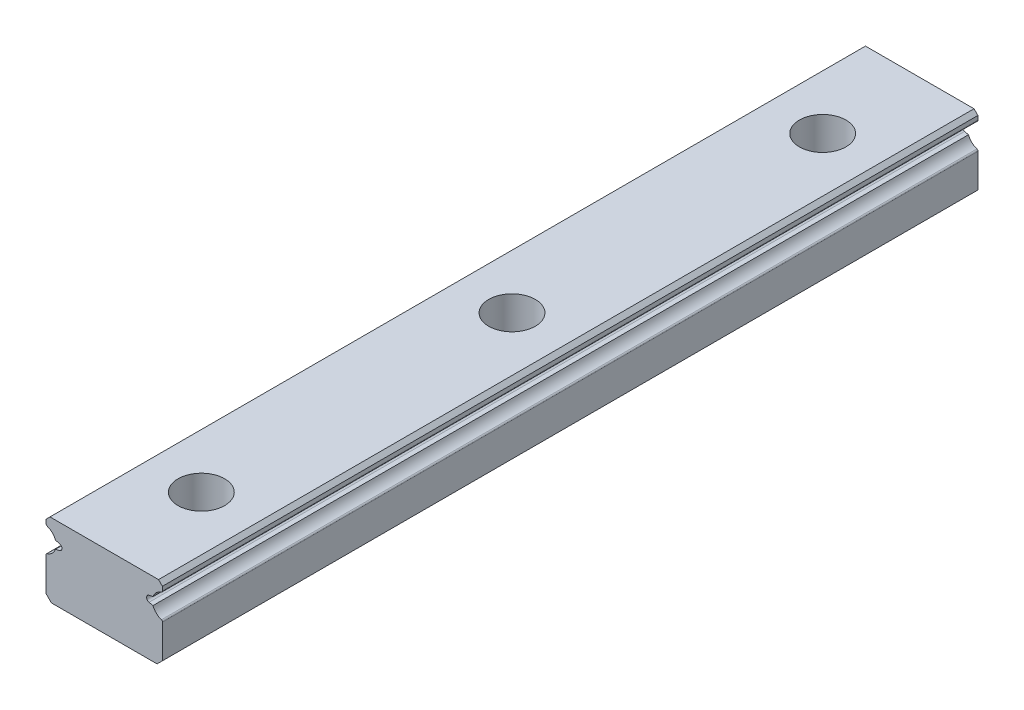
ISO-10303-21;
HEADER;
FILE_DESCRIPTION(('STEP AP214'),'2;1');
FILE_NAME('part.step','',(''),(''),'','','');
FILE_SCHEMA(('AUTOMOTIVE_DESIGN { 1 0 10303 214 1 1 1 1 }'));
ENDSEC;
DATA;
#1=APPLICATION_CONTEXT('core data for automotive mechanical design processes');
#2=APPLICATION_PROTOCOL_DEFINITION('international standard','automotive_design',2000,#1);
#3=PRODUCT_CONTEXT('',#1,'mechanical');
#4=PRODUCT('Part','Part','',(#3));
#5=PRODUCT_RELATED_PRODUCT_CATEGORY('part','',(#4));
#6=PRODUCT_DEFINITION_FORMATION('','',#4);
#7=PRODUCT_DEFINITION_CONTEXT('part definition',#1,'design');
#8=PRODUCT_DEFINITION('design','',#6,#7);
#9=PRODUCT_DEFINITION_SHAPE('','',#8);
#10=(LENGTH_UNIT() NAMED_UNIT(*) SI_UNIT(.MILLI.,.METRE.));
#11=(NAMED_UNIT(*) PLANE_ANGLE_UNIT() SI_UNIT($,.RADIAN.));
#12=(NAMED_UNIT(*) SI_UNIT($,.STERADIAN.) SOLID_ANGLE_UNIT());
#13=UNCERTAINTY_MEASURE_WITH_UNIT(LENGTH_MEASURE(1.E-05),#10,'distance_accuracy_value','');
#14=(GEOMETRIC_REPRESENTATION_CONTEXT(3) GLOBAL_UNCERTAINTY_ASSIGNED_CONTEXT((#13)) GLOBAL_UNIT_ASSIGNED_CONTEXT((#10,
#11,#12)) REPRESENTATION_CONTEXT('',''));
#15=CARTESIAN_POINT('',(0.,0.,0.));
#16=DIRECTION('',(0.,0.,1.));
#17=DIRECTION('',(1.,0.,0.));
#18=AXIS2_PLACEMENT_3D('',#15,#16,#17);
#19=CARTESIAN_POINT('',(-6.27999999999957,-8.749,-105.));
#20=DIRECTION('',(-0.209659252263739,-0.977774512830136,0.));
#21=DIRECTION('',(0.977774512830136,-0.209659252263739,0.));
#22=AXIS2_PLACEMENT_3D('',#19,#20,#21);
#23=PLANE('',#22);
#24=DIRECTION('',(0.977774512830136,-0.209659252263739,0.));
#25=VECTOR('',#24,1.);
#26=CARTESIAN_POINT('',(-6.27999999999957,-8.749,-105.));
#27=LINE('',#26,#25);
#28=CARTESIAN_POINT('',(-6.27999999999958,-8.749,-105.));
#29=VERTEX_POINT('',#28);
#30=CARTESIAN_POINT('',(-5.76751090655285,-8.85889044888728,-105.));
#31=VERTEX_POINT('',#30);
#32=EDGE_CURVE('E211',#29,#31,#27,.T.);
#33=ORIENTED_EDGE('',*,*,#32,.T.);
#34=DIRECTION('',(0.,0.,-1.));
#35=VECTOR('',#34,1.);
#36=CARTESIAN_POINT('',(-5.76751053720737,-8.85889052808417,-105.));
#37=LINE('',#36,#35);
#38=CARTESIAN_POINT('',(-5.76751090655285,-8.85889044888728,0.));
#39=VERTEX_POINT('',#38);
#40=EDGE_CURVE('E182',#31,#39,#37,.F.);
#41=ORIENTED_EDGE('',*,*,#40,.T.);
#42=DIRECTION('',(0.977774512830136,-0.209659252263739,0.));
#43=VECTOR('',#42,1.);
#44=CARTESIAN_POINT('',(-6.27999999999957,-8.749,0.));
#45=LINE('',#44,#43);
#46=CARTESIAN_POINT('',(-6.27999999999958,-8.749,0.));
#47=VERTEX_POINT('',#46);
#48=EDGE_CURVE('E219',#39,#47,#45,.F.);
#49=ORIENTED_EDGE('',*,*,#48,.T.);
#50=DIRECTION('',(0.,0.,-1.));
#51=VECTOR('',#50,1.);
#52=CARTESIAN_POINT('',(-6.27999999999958,-8.749,-105.));
#53=LINE('',#52,#51);
#54=EDGE_CURVE('E214',#47,#29,#53,.T.);
#55=ORIENTED_EDGE('',*,*,#54,.T.);
#56=EDGE_LOOP('',(#33,#41,#49,#55));
#57=FACE_BOUND('',#56,.T.);
#58=ADVANCED_FACE('F16',(#57),#23,.T.);
#59=CARTESIAN_POINT('',(5.7675105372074,-8.85889052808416,-105.));
#60=DIRECTION('',(0.20965925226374,-0.977774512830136,0.));
#61=DIRECTION('',(0.977774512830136,0.20965925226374,0.));
#62=AXIS2_PLACEMENT_3D('',#59,#60,#61);
#63=PLANE('',#62);
#64=DIRECTION('',(0.977774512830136,0.20965925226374,0.));
#65=VECTOR('',#64,1.);
#66=CARTESIAN_POINT('',(5.7675105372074,-8.85889052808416,-105.));
#67=LINE('',#66,#65);
#68=CARTESIAN_POINT('',(5.76751090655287,-8.85889044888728,-105.));
#69=VERTEX_POINT('',#68);
#70=CARTESIAN_POINT('',(6.27999999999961,-8.749,-105.));
#71=VERTEX_POINT('',#70);
#72=EDGE_CURVE('E184',#69,#71,#67,.T.);
#73=ORIENTED_EDGE('',*,*,#72,.T.);
#74=DIRECTION('',(0.,0.,-1.));
#75=VECTOR('',#74,1.);
#76=CARTESIAN_POINT('',(6.27999999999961,-8.749,-105.));
#77=LINE('',#76,#75);
#78=CARTESIAN_POINT('',(6.27999999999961,-8.749,0.));
#79=VERTEX_POINT('',#78);
#80=EDGE_CURVE('E222',#71,#79,#77,.F.);
#81=ORIENTED_EDGE('',*,*,#80,.T.);
#82=DIRECTION('',(0.977774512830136,0.20965925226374,0.));
#83=VECTOR('',#82,1.);
#84=CARTESIAN_POINT('',(5.7675105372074,-8.85889052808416,0.));
#85=LINE('',#84,#83);
#86=CARTESIAN_POINT('',(5.76751090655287,-8.85889044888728,0.));
#87=VERTEX_POINT('',#86);
#88=EDGE_CURVE('E209',#79,#87,#85,.F.);
#89=ORIENTED_EDGE('',*,*,#88,.T.);
#90=DIRECTION('',(0.,0.,-1.));
#91=VECTOR('',#90,1.);
#92=CARTESIAN_POINT('',(5.7675105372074,-8.85889052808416,-105.));
#93=LINE('',#92,#91);
#94=EDGE_CURVE('E204',#87,#69,#93,.T.);
#95=ORIENTED_EDGE('',*,*,#94,.T.);
#96=EDGE_LOOP('',(#73,#81,#89,#95));
#97=FACE_BOUND('',#96,.T.);
#98=ADVANCED_FACE('F792',(#97),#63,.T.);
#99=CARTESIAN_POINT('',(-5.85137497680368,-9.25000017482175,-105.));
#100=DIRECTION('',(0.,0.,-1.));
#101=DIRECTION('',(-1.,0.,0.));
#102=AXIS2_PLACEMENT_3D('',#99,#100,#101);
#103=CYLINDRICAL_SURFACE('',#102,0.4);
#104=ORIENTED_EDGE('',*,*,#40,.F.);
#105=CARTESIAN_POINT('',(-5.85137497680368,-9.25000017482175,-105.));
#106=DIRECTION('',(0.,0.,-1.));
#107=DIRECTION('',(-1.,0.,0.));
#108=AXIS2_PLACEMENT_3D('',#105,#106,#107);
#109=CIRCLE('',#108,0.4);
#110=CARTESIAN_POINT('',(-5.767,-9.641,-105.));
#111=VERTEX_POINT('',#110);
#112=EDGE_CURVE('E19',#111,#31,#109,.F.);
#113=ORIENTED_EDGE('',*,*,#112,.F.);
#114=DIRECTION('',(0.,0.,1.));
#115=VECTOR('',#114,1.);
#116=CARTESIAN_POINT('',(-5.767,-9.641,-105.));
#117=LINE('',#116,#115);
#118=CARTESIAN_POINT('',(-5.767,-9.641,0.));
#119=VERTEX_POINT('',#118);
#120=EDGE_CURVE('E179',#119,#111,#117,.F.);
#121=ORIENTED_EDGE('',*,*,#120,.F.);
#122=CARTESIAN_POINT('',(-5.85137497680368,-9.25000017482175,0.));
#123=DIRECTION('',(0.,0.,-1.));
#124=DIRECTION('',(-1.,0.,0.));
#125=AXIS2_PLACEMENT_3D('',#122,#123,#124);
#126=CIRCLE('',#125,0.4);
#127=EDGE_CURVE('E226',#39,#119,#126,.T.);
#128=ORIENTED_EDGE('',*,*,#127,.F.);
#129=EDGE_LOOP('',(#104,#113,#121,#128));
#130=FACE_BOUND('',#129,.T.);
#131=ADVANCED_FACE('F176',(#130),#103,.F.);
#132=CARTESIAN_POINT('',(7.89004225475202,-9.33975285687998,-105.));
#133=DIRECTION('',(0.,0.,-1.));
#134=DIRECTION('',(-1.,0.,0.));
#135=AXIS2_PLACEMENT_3D('',#132,#133,#134);
#136=CYLINDRICAL_SURFACE('',#135,1.715);
#137=ORIENTED_EDGE('',*,*,#80,.F.);
#138=CARTESIAN_POINT('',(7.89004225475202,-9.33975285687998,-105.));
#139=DIRECTION('',(0.,0.,-1.));
#140=DIRECTION('',(-1.,0.,0.));
#141=AXIS2_PLACEMENT_3D('',#138,#139,#140);
#142=CIRCLE('',#141,1.715);
#143=CARTESIAN_POINT('',(7.35000000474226,-7.71199999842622,-105.));
#144=VERTEX_POINT('',#143);
#145=EDGE_CURVE('E225',#144,#71,#142,.F.);
#146=ORIENTED_EDGE('',*,*,#145,.F.);
#147=DIRECTION('',(0.,0.,-1.));
#148=VECTOR('',#147,1.);
#149=CARTESIAN_POINT('',(7.35000000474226,-7.71199999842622,-105.));
#150=LINE('',#149,#148);
#151=CARTESIAN_POINT('',(7.35000000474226,-7.71199999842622,0.));
#152=VERTEX_POINT('',#151);
#153=EDGE_CURVE('E202',#152,#144,#150,.T.);
#154=ORIENTED_EDGE('',*,*,#153,.F.);
#155=CARTESIAN_POINT('',(7.89004225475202,-9.33975285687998,0.));
#156=DIRECTION('',(0.,0.,-1.));
#157=DIRECTION('',(-1.,0.,0.));
#158=AXIS2_PLACEMENT_3D('',#155,#156,#157);
#159=CIRCLE('',#158,1.715);
#160=EDGE_CURVE('E218',#79,#152,#159,.T.);
#161=ORIENTED_EDGE('',*,*,#160,.F.);
#162=EDGE_LOOP('',(#137,#146,#154,#161));
#163=FACE_BOUND('',#162,.T.);
#164=ADVANCED_FACE('F776',(#163),#136,.F.);
#165=CARTESIAN_POINT('',(-7.890042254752,-9.33975285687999,-105.));
#166=DIRECTION('',(0.,0.,-1.));
#167=DIRECTION('',(-1.,0.,0.));
#168=AXIS2_PLACEMENT_3D('',#165,#166,#167);
#169=CYLINDRICAL_SURFACE('',#168,1.715);
#170=DIRECTION('',(0.,0.,-1.));
#171=VECTOR('',#170,1.);
#172=CARTESIAN_POINT('',(-7.34999999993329,-7.7120000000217,-105.));
#173=LINE('',#172,#171);
#174=CARTESIAN_POINT('',(-7.34999999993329,-7.71200000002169,-105.));
#175=VERTEX_POINT('',#174);
#176=CARTESIAN_POINT('',(-7.34999999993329,-7.7120000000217,0.));
#177=VERTEX_POINT('',#176);
#178=EDGE_CURVE('E297',#175,#177,#173,.F.);
#179=ORIENTED_EDGE('',*,*,#178,.F.);
#180=CARTESIAN_POINT('',(-7.890042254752,-9.33975285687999,-105.));
#181=DIRECTION('',(0.,0.,-1.));
#182=DIRECTION('',(-1.,0.,0.));
#183=AXIS2_PLACEMENT_3D('',#180,#181,#182);
#184=CIRCLE('',#183,1.715);
#185=EDGE_CURVE('E217',#29,#175,#184,.F.);
#186=ORIENTED_EDGE('',*,*,#185,.F.);
#187=ORIENTED_EDGE('',*,*,#54,.F.);
#188=CARTESIAN_POINT('',(-7.890042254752,-9.33975285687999,0.));
#189=DIRECTION('',(0.,0.,-1.));
#190=DIRECTION('',(-1.,0.,0.));
#191=AXIS2_PLACEMENT_3D('',#188,#189,#190);
#192=CIRCLE('',#191,1.715);
#193=EDGE_CURVE('E208',#177,#47,#192,.T.);
#194=ORIENTED_EDGE('',*,*,#193,.F.);
#195=EDGE_LOOP('',(#179,#186,#187,#194));
#196=FACE_BOUND('',#195,.T.);
#197=ADVANCED_FACE('F322',(#196),#169,.F.);
#198=CARTESIAN_POINT('',(5.85137497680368,-9.25000017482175,-105.));
#199=DIRECTION('',(0.,0.,-1.));
#200=DIRECTION('',(-1.,0.,0.));
#201=AXIS2_PLACEMENT_3D('',#198,#199,#200);
#202=CYLINDRICAL_SURFACE('',#201,0.4);
#203=DIRECTION('',(0.,0.,1.));
#204=VECTOR('',#203,1.);
#205=CARTESIAN_POINT('',(5.767,-9.641,-105.));
#206=LINE('',#205,#204);
#207=CARTESIAN_POINT('',(5.767,-9.641,-105.));
#208=VERTEX_POINT('',#207);
#209=CARTESIAN_POINT('',(5.767,-9.641,0.));
#210=VERTEX_POINT('',#209);
#211=EDGE_CURVE('E293',#208,#210,#206,.T.);
#212=ORIENTED_EDGE('',*,*,#211,.F.);
#213=CARTESIAN_POINT('',(5.85137497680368,-9.25000017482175,-105.));
#214=DIRECTION('',(0.,0.,-1.));
#215=DIRECTION('',(-1.,0.,0.));
#216=AXIS2_PLACEMENT_3D('',#213,#214,#215);
#217=CIRCLE('',#216,0.4);
#218=EDGE_CURVE('E207',#69,#208,#217,.F.);
#219=ORIENTED_EDGE('',*,*,#218,.F.);
#220=ORIENTED_EDGE('',*,*,#94,.F.);
#221=CARTESIAN_POINT('',(5.85137497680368,-9.25000017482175,0.));
#222=DIRECTION('',(0.,0.,-1.));
#223=DIRECTION('',(-1.,0.,0.));
#224=AXIS2_PLACEMENT_3D('',#221,#222,#223);
#225=CIRCLE('',#224,0.4);
#226=EDGE_CURVE('E198',#210,#87,#225,.T.);
#227=ORIENTED_EDGE('',*,*,#226,.F.);
#228=EDGE_LOOP('',(#212,#219,#220,#227));
#229=FACE_BOUND('',#228,.T.);
#230=ADVANCED_FACE('F760',(#229),#202,.F.);
#231=CARTESIAN_POINT('',(-5.767,-9.641,-105.));
#232=DIRECTION('',(-0.207835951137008,0.978163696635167,0.));
#233=DIRECTION('',(-0.978163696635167,-0.207835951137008,0.));
#234=AXIS2_PLACEMENT_3D('',#231,#232,#233);
#235=PLANE('',#234);
#236=DIRECTION('',(-0.978163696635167,-0.207835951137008,0.));
#237=VECTOR('',#236,1.);
#238=CARTESIAN_POINT('',(-5.767,-9.641,-105.));
#239=LINE('',#238,#237);
#240=CARTESIAN_POINT('',(-6.28,-9.75,-105.));
#241=VERTEX_POINT('',#240);
#242=EDGE_CURVE('E186',#111,#241,#239,.T.);
#243=ORIENTED_EDGE('',*,*,#242,.T.);
#244=DIRECTION('',(0.,0.,-1.));
#245=VECTOR('',#244,1.);
#246=CARTESIAN_POINT('',(-6.28,-9.75,-105.));
#247=LINE('',#246,#245);
#248=CARTESIAN_POINT('',(-6.28,-9.75,0.));
#249=VERTEX_POINT('',#248);
#250=EDGE_CURVE('E291',#241,#249,#247,.F.);
#251=ORIENTED_EDGE('',*,*,#250,.T.);
#252=DIRECTION('',(-0.978163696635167,-0.207835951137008,0.));
#253=VECTOR('',#252,1.);
#254=CARTESIAN_POINT('',(-5.767,-9.641,0.));
#255=LINE('',#254,#253);
#256=EDGE_CURVE('E196',#249,#119,#255,.F.);
#257=ORIENTED_EDGE('',*,*,#256,.T.);
#258=ORIENTED_EDGE('',*,*,#120,.T.);
#259=EDGE_LOOP('',(#243,#251,#257,#258));
#260=FACE_BOUND('',#259,.T.);
#261=ADVANCED_FACE('F195',(#260),#235,.T.);
#262=CARTESIAN_POINT('',(7.287,-7.52218166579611,-105.));
#263=DIRECTION('',(0.,0.,-1.));
#264=DIRECTION('',(-1.,0.,0.));
#265=AXIS2_PLACEMENT_3D('',#262,#263,#264);
#266=CYLINDRICAL_SURFACE('',#265,0.2);
#267=CARTESIAN_POINT('',(7.287,-7.52218166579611,-105.));
#268=DIRECTION('',(0.,0.,-1.));
#269=DIRECTION('',(-1.,0.,0.));
#270=AXIS2_PLACEMENT_3D('',#267,#268,#269);
#271=CIRCLE('',#270,0.2);
#272=CARTESIAN_POINT('',(7.487,-7.52218165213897,-105.));
#273=VERTEX_POINT('',#272);
#274=EDGE_CURVE('E301',#144,#273,#271,.F.);
#275=ORIENTED_EDGE('',*,*,#274,.T.);
#276=DIRECTION('',(0.,0.,-1.));
#277=VECTOR('',#276,1.);
#278=CARTESIAN_POINT('',(7.487,-7.52218163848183,-105.));
#279=LINE('',#278,#277);
#280=CARTESIAN_POINT('',(7.487,-7.52218165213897,0.));
#281=VERTEX_POINT('',#280);
#282=EDGE_CURVE('E359',#281,#273,#279,.T.);
#283=ORIENTED_EDGE('',*,*,#282,.F.);
#284=CARTESIAN_POINT('',(7.287,-7.52218166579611,0.));
#285=DIRECTION('',(0.,0.,-1.));
#286=DIRECTION('',(-1.,0.,0.));
#287=AXIS2_PLACEMENT_3D('',#284,#285,#286);
#288=CIRCLE('',#287,0.2);
#289=EDGE_CURVE('E193',#281,#152,#288,.T.);
#290=ORIENTED_EDGE('',*,*,#289,.T.);
#291=ORIENTED_EDGE('',*,*,#153,.T.);
#292=EDGE_LOOP('',(#275,#283,#290,#291));
#293=FACE_BOUND('',#292,.T.);
#294=ADVANCED_FACE('F745',(#293),#266,.T.);
#295=CARTESIAN_POINT('',(-7.288,-7.52185268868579,-105.));
#296=DIRECTION('',(0.,0.,-1.));
#297=DIRECTION('',(-1.,0.,0.));
#298=AXIS2_PLACEMENT_3D('',#295,#296,#297);
#299=CYLINDRICAL_SURFACE('',#298,0.200000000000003);
#300=CARTESIAN_POINT('',(-7.288,-7.52185268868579,-105.));
#301=DIRECTION('',(0.,0.,-1.));
#302=DIRECTION('',(-1.,0.,0.));
#303=AXIS2_PLACEMENT_3D('',#300,#301,#302);
#304=CIRCLE('',#303,0.200000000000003);
#305=CARTESIAN_POINT('',(-7.488,-7.52185267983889,-105.));
#306=VERTEX_POINT('',#305);
#307=EDGE_CURVE('E294',#306,#175,#304,.F.);
#308=ORIENTED_EDGE('',*,*,#307,.T.);
#309=ORIENTED_EDGE('',*,*,#178,.T.);
#310=CARTESIAN_POINT('',(-7.288,-7.52185268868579,0.));
#311=DIRECTION('',(0.,0.,-1.));
#312=DIRECTION('',(-1.,0.,0.));
#313=AXIS2_PLACEMENT_3D('',#310,#311,#312);
#314=CIRCLE('',#313,0.200000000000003);
#315=CARTESIAN_POINT('',(-7.488,-7.52185267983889,0.));
#316=VERTEX_POINT('',#315);
#317=EDGE_CURVE('E298',#177,#316,#314,.T.);
#318=ORIENTED_EDGE('',*,*,#317,.T.);
#319=DIRECTION('',(0.,0.,1.));
#320=VECTOR('',#319,1.);
#321=CARTESIAN_POINT('',(-7.488,-7.52185267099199,-105.));
#322=LINE('',#321,#320);
#323=EDGE_CURVE('E327',#306,#316,#322,.T.);
#324=ORIENTED_EDGE('',*,*,#323,.F.);
#325=EDGE_LOOP('',(#308,#309,#318,#324));
#326=FACE_BOUND('',#325,.T.);
#327=ADVANCED_FACE('F325',(#326),#299,.T.);
#328=CARTESIAN_POINT('',(6.28,-9.75,-105.));
#329=DIRECTION('',(0.207835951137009,0.978163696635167,0.));
#330=DIRECTION('',(-0.978163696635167,0.207835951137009,0.));
#331=AXIS2_PLACEMENT_3D('',#328,#329,#330);
#332=PLANE('',#331);
#333=DIRECTION('',(-0.978163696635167,0.207835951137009,0.));
#334=VECTOR('',#333,1.);
#335=CARTESIAN_POINT('',(6.28,-9.75,-105.));
#336=LINE('',#335,#334);
#337=CARTESIAN_POINT('',(6.28,-9.75,-105.));
#338=VERTEX_POINT('',#337);
#339=EDGE_CURVE('E383',#338,#208,#336,.T.);
#340=ORIENTED_EDGE('',*,*,#339,.T.);
#341=ORIENTED_EDGE('',*,*,#211,.T.);
#342=DIRECTION('',(-0.978163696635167,0.207835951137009,0.));
#343=VECTOR('',#342,1.);
#344=CARTESIAN_POINT('',(6.28,-9.75,0.));
#345=LINE('',#344,#343);
#346=CARTESIAN_POINT('',(6.28,-9.75,0.));
#347=VERTEX_POINT('',#346);
#348=EDGE_CURVE('E324',#210,#347,#345,.F.);
#349=ORIENTED_EDGE('',*,*,#348,.T.);
#350=DIRECTION('',(0.,0.,-1.));
#351=VECTOR('',#350,1.);
#352=CARTESIAN_POINT('',(6.28,-9.75,-105.));
#353=LINE('',#352,#351);
#354=EDGE_CURVE('E287',#347,#338,#353,.T.);
#355=ORIENTED_EDGE('',*,*,#354,.T.);
#356=EDGE_LOOP('',(#340,#341,#349,#355));
#357=FACE_BOUND('',#356,.T.);
#358=ADVANCED_FACE('F490',(#357),#332,.T.);
#359=CARTESIAN_POINT('',(-7.89007044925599,-9.159323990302,-105.));
#360=DIRECTION('',(0.,0.,-1.));
#361=DIRECTION('',(-1.,0.,0.));
#362=AXIS2_PLACEMENT_3D('',#359,#360,#361);
#363=CYLINDRICAL_SURFACE('',#362,1.715);
#364=ORIENTED_EDGE('',*,*,#250,.F.);
#365=CARTESIAN_POINT('',(-7.89007044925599,-9.159323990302,-105.));
#366=DIRECTION('',(0.,0.,-1.));
#367=DIRECTION('',(-1.,0.,0.));
#368=AXIS2_PLACEMENT_3D('',#365,#366,#367);
#369=CIRCLE('',#368,1.715);
#370=CARTESIAN_POINT('',(-7.36199999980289,-10.7909999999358,-105.));
#371=VERTEX_POINT('',#370);
#372=EDGE_CURVE('E189',#371,#241,#369,.F.);
#373=ORIENTED_EDGE('',*,*,#372,.F.);
#374=DIRECTION('',(0.,0.,-1.));
#375=VECTOR('',#374,1.);
#376=CARTESIAN_POINT('',(-7.36199999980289,-10.7909999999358,-105.));
#377=LINE('',#376,#375);
#378=CARTESIAN_POINT('',(-7.36199999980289,-10.7909999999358,0.));
#379=VERTEX_POINT('',#378);
#380=EDGE_CURVE('E278',#379,#371,#377,.T.);
#381=ORIENTED_EDGE('',*,*,#380,.F.);
#382=CARTESIAN_POINT('',(-7.89007044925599,-9.159323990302,0.));
#383=DIRECTION('',(0.,0.,-1.));
#384=DIRECTION('',(-1.,0.,0.));
#385=AXIS2_PLACEMENT_3D('',#382,#383,#384);
#386=CIRCLE('',#385,1.715);
#387=EDGE_CURVE('E288',#249,#379,#386,.T.);
#388=ORIENTED_EDGE('',*,*,#387,.F.);
#389=EDGE_LOOP('',(#364,#373,#381,#388));
#390=FACE_BOUND('',#389,.T.);
#391=ADVANCED_FACE('F487',(#390),#363,.F.);
#392=CARTESIAN_POINT('',(7.487,-7.52218163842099,-105.));
#393=DIRECTION('',(1.,0.,0.));
#394=DIRECTION('',(0.,0.,-1.));
#395=AXIS2_PLACEMENT_3D('',#392,#393,#394);
#396=PLANE('',#395);
#397=DIRECTION('',(0.,1.,0.));
#398=VECTOR('',#397,1.);
#399=CARTESIAN_POINT('',(7.487,-7.52218163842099,-105.));
#400=LINE('',#399,#398);
#401=CARTESIAN_POINT('',(7.487,-7.,-105.));
#402=VERTEX_POINT('',#401);
#403=EDGE_CURVE('E339',#273,#402,#400,.T.);
#404=ORIENTED_EDGE('',*,*,#403,.T.);
#405=DIRECTION('',(0.,0.,1.));
#406=VECTOR('',#405,1.);
#407=CARTESIAN_POINT('',(7.487,-7.,-105.));
#408=LINE('',#407,#406);
#409=CARTESIAN_POINT('',(7.487,-7.,0.));
#410=VERTEX_POINT('',#409);
#411=EDGE_CURVE('E366',#410,#402,#408,.F.);
#412=ORIENTED_EDGE('',*,*,#411,.F.);
#413=DIRECTION('',(0.,1.,0.));
#414=VECTOR('',#413,1.);
#415=CARTESIAN_POINT('',(7.487,-7.52218163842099,0.));
#416=LINE('',#415,#414);
#417=EDGE_CURVE('E290',#410,#281,#416,.F.);
#418=ORIENTED_EDGE('',*,*,#417,.T.);
#419=ORIENTED_EDGE('',*,*,#282,.T.);
#420=EDGE_LOOP('',(#404,#412,#418,#419));
#421=FACE_BOUND('',#420,.T.);
#422=ADVANCED_FACE('F489',(#421),#396,.T.);
#423=CARTESIAN_POINT('',(-7.488,-7.,-105.));
#424=DIRECTION('',(-1.,0.,0.));
#425=DIRECTION('',(0.,0.,1.));
#426=AXIS2_PLACEMENT_3D('',#423,#424,#425);
#427=PLANE('',#426);
#428=DIRECTION('',(0.,1.,0.));
#429=VECTOR('',#428,1.);
#430=CARTESIAN_POINT('',(-7.488,-7.,-105.));
#431=LINE('',#430,#429);
#432=CARTESIAN_POINT('',(-7.488,-7.,-105.));
#433=VERTEX_POINT('',#432);
#434=EDGE_CURVE('E331',#433,#306,#431,.F.);
#435=ORIENTED_EDGE('',*,*,#434,.T.);
#436=ORIENTED_EDGE('',*,*,#323,.T.);
#437=DIRECTION('',(0.,1.,0.));
#438=VECTOR('',#437,1.);
#439=CARTESIAN_POINT('',(-7.488,-7.,0.));
#440=LINE('',#439,#438);
#441=CARTESIAN_POINT('',(-7.488,-7.,0.));
#442=VERTEX_POINT('',#441);
#443=EDGE_CURVE('E337',#316,#442,#440,.T.);
#444=ORIENTED_EDGE('',*,*,#443,.T.);
#445=DIRECTION('',(0.,0.,1.));
#446=VECTOR('',#445,1.);
#447=CARTESIAN_POINT('',(-7.488,-7.,-105.));
#448=LINE('',#447,#446);
#449=EDGE_CURVE('E274',#433,#442,#448,.T.);
#450=ORIENTED_EDGE('',*,*,#449,.F.);
#451=EDGE_LOOP('',(#435,#436,#444,#450));
#452=FACE_BOUND('',#451,.T.);
#453=ADVANCED_FACE('F334',(#452),#427,.T.);
#454=CARTESIAN_POINT('',(7.890070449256,-9.159323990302,-105.));
#455=DIRECTION('',(0.,0.,-1.));
#456=DIRECTION('',(-1.,0.,0.));
#457=AXIS2_PLACEMENT_3D('',#454,#455,#456);
#458=CYLINDRICAL_SURFACE('',#457,1.715);
#459=DIRECTION('',(0.,0.,-1.));
#460=VECTOR('',#459,1.);
#461=CARTESIAN_POINT('',(7.36199999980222,-10.7909999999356,-105.));
#462=LINE('',#461,#460);
#463=CARTESIAN_POINT('',(7.36199999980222,-10.7909999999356,-105.));
#464=VERTEX_POINT('',#463);
#465=CARTESIAN_POINT('',(7.36199999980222,-10.7909999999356,0.));
#466=VERTEX_POINT('',#465);
#467=EDGE_CURVE('E268',#464,#466,#462,.F.);
#468=ORIENTED_EDGE('',*,*,#467,.F.);
#469=CARTESIAN_POINT('',(7.890070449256,-9.159323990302,-105.));
#470=DIRECTION('',(0.,0.,-1.));
#471=DIRECTION('',(-1.,0.,0.));
#472=AXIS2_PLACEMENT_3D('',#469,#470,#471);
#473=CIRCLE('',#472,1.715);
#474=EDGE_CURVE('E285',#338,#464,#473,.F.);
#475=ORIENTED_EDGE('',*,*,#474,.F.);
#476=ORIENTED_EDGE('',*,*,#354,.F.);
#477=CARTESIAN_POINT('',(7.890070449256,-9.159323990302,0.));
#478=DIRECTION('',(0.,0.,-1.));
#479=DIRECTION('',(-1.,0.,0.));
#480=AXIS2_PLACEMENT_3D('',#477,#478,#479);
#481=CIRCLE('',#480,1.715);
#482=EDGE_CURVE('E282',#466,#347,#481,.T.);
#483=ORIENTED_EDGE('',*,*,#482,.F.);
#484=EDGE_LOOP('',(#468,#475,#476,#483));
#485=FACE_BOUND('',#484,.T.);
#486=ADVANCED_FACE('F577',(#485),#458,.F.);
#487=CARTESIAN_POINT('',(-7.3,-10.9811473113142,-105.));
#488=DIRECTION('',(0.,0.,-1.));
#489=DIRECTION('',(-1.,0.,0.));
#490=AXIS2_PLACEMENT_3D('',#487,#488,#489);
#491=CYLINDRICAL_SURFACE('',#490,0.200000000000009);
#492=CARTESIAN_POINT('',(-7.3,-10.9811473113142,-105.));
#493=DIRECTION('',(0.,0.,-1.));
#494=DIRECTION('',(-1.,0.,0.));
#495=AXIS2_PLACEMENT_3D('',#492,#493,#494);
#496=CIRCLE('',#495,0.200000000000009);
#497=CARTESIAN_POINT('',(-7.5,-10.9811473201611,-105.));
#498=VERTEX_POINT('',#497);
#499=EDGE_CURVE('E275',#371,#498,#496,.F.);
#500=ORIENTED_EDGE('',*,*,#499,.T.);
#501=DIRECTION('',(0.,0.,1.));
#502=VECTOR('',#501,1.);
#503=CARTESIAN_POINT('',(-7.5,-10.981147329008,-105.));
#504=LINE('',#503,#502);
#505=CARTESIAN_POINT('',(-7.5,-10.9811473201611,0.));
#506=VERTEX_POINT('',#505);
#507=EDGE_CURVE('E264',#506,#498,#504,.F.);
#508=ORIENTED_EDGE('',*,*,#507,.F.);
#509=CARTESIAN_POINT('',(-7.3,-10.9811473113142,0.));
#510=DIRECTION('',(0.,0.,-1.));
#511=DIRECTION('',(-1.,0.,0.));
#512=AXIS2_PLACEMENT_3D('',#509,#510,#511);
#513=CIRCLE('',#512,0.200000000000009);
#514=EDGE_CURVE('E279',#506,#379,#513,.T.);
#515=ORIENTED_EDGE('',*,*,#514,.T.);
#516=ORIENTED_EDGE('',*,*,#380,.T.);
#517=EDGE_LOOP('',(#500,#508,#515,#516));
#518=FACE_BOUND('',#517,.T.);
#519=ADVANCED_FACE('F483',(#518),#491,.T.);
#520=CARTESIAN_POINT('',(0.,-16.,-52.5));
#521=DIRECTION('',(0.,1.,0.));
#522=DIRECTION('',(0.,0.,1.));
#523=AXIS2_PLACEMENT_3D('',#520,#521,#522);
#524=CYLINDRICAL_SURFACE('',#523,3.);
#525=CARTESIAN_POINT('',(0.,-6.5,-52.5));
#526=DIRECTION('',(0.,1.,0.));
#527=DIRECTION('',(0.,0.,1.));
#528=AXIS2_PLACEMENT_3D('',#525,#526,#527);
#529=CIRCLE('',#528,3.);
#530=CARTESIAN_POINT('',(0.,-6.5,-49.5));
#531=VERTEX_POINT('',#530);
#532=EDGE_CURVE('E260',#531,#531,#529,.F.);
#533=ORIENTED_EDGE('',*,*,#532,.F.);
#534=EDGE_LOOP('',(#533));
#535=FACE_BOUND('',#534,.T.);
#536=CARTESIAN_POINT('',(0.,-11.,-52.5));
#537=DIRECTION('',(0.,1.,0.));
#538=DIRECTION('',(0.,0.,1.));
#539=AXIS2_PLACEMENT_3D('',#536,#537,#538);
#540=CIRCLE('',#539,3.);
#541=CARTESIAN_POINT('',(0.,-11.,-49.5));
#542=VERTEX_POINT('',#541);
#543=EDGE_CURVE('E265',#542,#542,#540,.T.);
#544=ORIENTED_EDGE('',*,*,#543,.F.);
#545=EDGE_LOOP('',(#544));
#546=FACE_BOUND('',#545,.T.);
#547=ADVANCED_FACE('F570',(#535,#546),#524,.F.);
#548=CARTESIAN_POINT('',(7.487,-7.,-105.));
#549=DIRECTION('',(0.707106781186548,0.707106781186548,0.));
#550=DIRECTION('',(-0.707106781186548,0.707106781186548,0.));
#551=AXIS2_PLACEMENT_3D('',#548,#549,#550);
#552=PLANE('',#551);
#553=DIRECTION('',(-0.707106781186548,0.707106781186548,0.));
#554=VECTOR('',#553,1.);
#555=CARTESIAN_POINT('',(7.487,-7.,-105.));
#556=LINE('',#555,#554);
#557=CARTESIAN_POINT('',(6.987,-6.5,-105.));
#558=VERTEX_POINT('',#557);
#559=EDGE_CURVE('E356',#402,#558,#556,.T.);
#560=ORIENTED_EDGE('',*,*,#559,.T.);
#561=DIRECTION('',(0.,0.,1.));
#562=VECTOR('',#561,1.);
#563=CARTESIAN_POINT('',(6.987,-6.5,-105.));
#564=LINE('',#563,#562);
#565=CARTESIAN_POINT('',(6.987,-6.5,0.));
#566=VERTEX_POINT('',#565);
#567=EDGE_CURVE('E263',#566,#558,#564,.F.);
#568=ORIENTED_EDGE('',*,*,#567,.F.);
#569=DIRECTION('',(-0.707106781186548,0.707106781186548,0.));
#570=VECTOR('',#569,1.);
#571=CARTESIAN_POINT('',(7.487,-7.,0.));
#572=LINE('',#571,#570);
#573=EDGE_CURVE('E277',#566,#410,#572,.F.);
#574=ORIENTED_EDGE('',*,*,#573,.T.);
#575=ORIENTED_EDGE('',*,*,#411,.T.);
#576=EDGE_LOOP('',(#560,#568,#574,#575));
#577=FACE_BOUND('',#576,.T.);
#578=ADVANCED_FACE('F566',(#577),#552,.T.);
#579=CARTESIAN_POINT('',(-6.988,-6.5,-105.));
#580=DIRECTION('',(-0.707106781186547,0.707106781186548,0.));
#581=DIRECTION('',(-0.707106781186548,-0.707106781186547,0.));
#582=AXIS2_PLACEMENT_3D('',#579,#580,#581);
#583=PLANE('',#582);
#584=DIRECTION('',(-0.707106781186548,-0.707106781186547,0.));
#585=VECTOR('',#584,1.);
#586=CARTESIAN_POINT('',(-6.988,-6.5,-105.));
#587=LINE('',#586,#585);
#588=CARTESIAN_POINT('',(-6.988,-6.5,-105.));
#589=VERTEX_POINT('',#588);
#590=EDGE_CURVE('E346',#589,#433,#587,.T.);
#591=ORIENTED_EDGE('',*,*,#590,.T.);
#592=ORIENTED_EDGE('',*,*,#449,.T.);
#593=DIRECTION('',(-0.707106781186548,-0.707106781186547,0.));
#594=VECTOR('',#593,1.);
#595=CARTESIAN_POINT('',(-6.988,-6.5,0.));
#596=LINE('',#595,#594);
#597=CARTESIAN_POINT('',(-6.988,-6.5,0.));
#598=VERTEX_POINT('',#597);
#599=EDGE_CURVE('E350',#442,#598,#596,.F.);
#600=ORIENTED_EDGE('',*,*,#599,.T.);
#601=DIRECTION('',(0.,0.,1.));
#602=VECTOR('',#601,1.);
#603=CARTESIAN_POINT('',(-6.988,-6.5,-105.));
#604=LINE('',#603,#602);
#605=EDGE_CURVE('E259',#589,#598,#604,.T.);
#606=ORIENTED_EDGE('',*,*,#605,.F.);
#607=EDGE_LOOP('',(#591,#592,#600,#606));
#608=FACE_BOUND('',#607,.T.);
#609=ADVANCED_FACE('F562',(#608),#583,.T.);
#610=CARTESIAN_POINT('',(7.3,-10.9811473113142,-105.));
#611=DIRECTION('',(0.,0.,-1.));
#612=DIRECTION('',(-1.,0.,0.));
#613=AXIS2_PLACEMENT_3D('',#610,#611,#612);
#614=CYLINDRICAL_SURFACE('',#613,0.2);
#615=CARTESIAN_POINT('',(7.3,-10.9811473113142,-105.));
#616=DIRECTION('',(0.,0.,-1.));
#617=DIRECTION('',(-1.,0.,0.));
#618=AXIS2_PLACEMENT_3D('',#615,#616,#617);
#619=CIRCLE('',#618,0.2);
#620=CARTESIAN_POINT('',(7.5,-10.9811473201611,-105.));
#621=VERTEX_POINT('',#620);
#622=EDGE_CURVE('E269',#621,#464,#619,.F.);
#623=ORIENTED_EDGE('',*,*,#622,.T.);
#624=ORIENTED_EDGE('',*,*,#467,.T.);
#625=CARTESIAN_POINT('',(7.3,-10.9811473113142,0.));
#626=DIRECTION('',(0.,0.,-1.));
#627=DIRECTION('',(-1.,0.,0.));
#628=AXIS2_PLACEMENT_3D('',#625,#626,#627);
#629=CIRCLE('',#628,0.2);
#630=CARTESIAN_POINT('',(7.5,-10.9811473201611,0.));
#631=VERTEX_POINT('',#630);
#632=EDGE_CURVE('E272',#466,#631,#629,.T.);
#633=ORIENTED_EDGE('',*,*,#632,.T.);
#634=DIRECTION('',(0.,0.,-1.));
#635=VECTOR('',#634,1.);
#636=CARTESIAN_POINT('',(7.5,-10.981147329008,-105.));
#637=LINE('',#636,#635);
#638=EDGE_CURVE('E252',#621,#631,#637,.F.);
#639=ORIENTED_EDGE('',*,*,#638,.F.);
#640=EDGE_LOOP('',(#623,#624,#633,#639));
#641=FACE_BOUND('',#640,.T.);
#642=ADVANCED_FACE('F558',(#641),#614,.T.);
#643=CARTESIAN_POINT('',(0.,-16.,-12.5));
#644=DIRECTION('',(0.,1.,0.));
#645=DIRECTION('',(0.,0.,1.));
#646=AXIS2_PLACEMENT_3D('',#643,#644,#645);
#647=CYLINDRICAL_SURFACE('',#646,3.);
#648=CARTESIAN_POINT('',(0.,-6.5,-12.5));
#649=DIRECTION('',(0.,1.,0.));
#650=DIRECTION('',(0.,0.,1.));
#651=AXIS2_PLACEMENT_3D('',#648,#649,#650);
#652=CIRCLE('',#651,3.);
#653=CARTESIAN_POINT('',(0.,-6.5,-9.5));
#654=VERTEX_POINT('',#653);
#655=EDGE_CURVE('E256',#654,#654,#652,.F.);
#656=ORIENTED_EDGE('',*,*,#655,.F.);
#657=EDGE_LOOP('',(#656));
#658=FACE_BOUND('',#657,.T.);
#659=CARTESIAN_POINT('',(0.,-11.,-12.5));
#660=DIRECTION('',(0.,1.,0.));
#661=DIRECTION('',(0.,0.,1.));
#662=AXIS2_PLACEMENT_3D('',#659,#660,#661);
#663=CIRCLE('',#662,3.);
#664=CARTESIAN_POINT('',(0.,-11.,-9.5));
#665=VERTEX_POINT('',#664);
#666=EDGE_CURVE('E249',#665,#665,#663,.T.);
#667=ORIENTED_EDGE('',*,*,#666,.F.);
#668=EDGE_LOOP('',(#667));
#669=FACE_BOUND('',#668,.T.);
#670=ADVANCED_FACE('F554',(#658,#669),#647,.F.);
#671=CARTESIAN_POINT('',(0.,-16.,-92.5));
#672=DIRECTION('',(0.,1.,0.));
#673=DIRECTION('',(0.,0.,1.));
#674=AXIS2_PLACEMENT_3D('',#671,#672,#673);
#675=CYLINDRICAL_SURFACE('',#674,3.);
#676=CARTESIAN_POINT('',(0.,-6.5,-92.5));
#677=DIRECTION('',(0.,1.,0.));
#678=DIRECTION('',(0.,0.,1.));
#679=AXIS2_PLACEMENT_3D('',#676,#677,#678);
#680=CIRCLE('',#679,3.);
#681=CARTESIAN_POINT('',(0.,-6.5,-89.5));
#682=VERTEX_POINT('',#681);
#683=EDGE_CURVE('E253',#682,#682,#680,.F.);
#684=ORIENTED_EDGE('',*,*,#683,.F.);
#685=EDGE_LOOP('',(#684));
#686=FACE_BOUND('',#685,.T.);
#687=CARTESIAN_POINT('',(0.,-11.,-92.5));
#688=DIRECTION('',(0.,1.,0.));
#689=DIRECTION('',(0.,0.,1.));
#690=AXIS2_PLACEMENT_3D('',#687,#688,#689);
#691=CIRCLE('',#690,3.);
#692=CARTESIAN_POINT('',(0.,-11.,-89.5));
#693=VERTEX_POINT('',#692);
#694=EDGE_CURVE('E246',#693,#693,#691,.T.);
#695=ORIENTED_EDGE('',*,*,#694,.F.);
#696=EDGE_LOOP('',(#695));
#697=FACE_BOUND('',#696,.T.);
#698=ADVANCED_FACE('F550',(#686,#697),#675,.F.);
#699=CARTESIAN_POINT('',(0.,-11.,-55.5));
#700=DIRECTION('',(0.,1.,0.));
#701=DIRECTION('',(0.,0.,1.));
#702=AXIS2_PLACEMENT_3D('',#699,#700,#701);
#703=PLANE('',#702);
#704=ORIENTED_EDGE('',*,*,#543,.T.);
#705=EDGE_LOOP('',(#704));
#706=FACE_BOUND('',#705,.T.);
#707=CARTESIAN_POINT('',(0.,-11.,-52.5));
#708=DIRECTION('',(0.,1.,0.));
#709=DIRECTION('',(0.,0.,1.));
#710=AXIS2_PLACEMENT_3D('',#707,#708,#709);
#711=CIRCLE('',#710,1.75);
#712=CARTESIAN_POINT('',(0.,-11.,-50.75));
#713=VERTEX_POINT('',#712);
#714=EDGE_CURVE('E242',#713,#713,#711,.F.);
#715=ORIENTED_EDGE('',*,*,#714,.T.);
#716=EDGE_LOOP('',(#715));
#717=FACE_BOUND('',#716,.T.);
#718=ADVANCED_FACE('F547',(#706,#717),#703,.T.);
#719=CARTESIAN_POINT('',(-7.5,-10.981147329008,-105.));
#720=DIRECTION('',(-1.,0.,0.));
#721=DIRECTION('',(0.,0.,1.));
#722=AXIS2_PLACEMENT_3D('',#719,#720,#721);
#723=PLANE('',#722);
#724=DIRECTION('',(0.,1.,0.));
#725=VECTOR('',#724,1.);
#726=CARTESIAN_POINT('',(-7.5,-10.9811473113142,-105.));
#727=LINE('',#726,#725);
#728=CARTESIAN_POINT('',(-7.5,-15.3,-105.));
#729=VERTEX_POINT('',#728);
#730=EDGE_CURVE('E423',#498,#729,#727,.F.);
#731=ORIENTED_EDGE('',*,*,#730,.T.);
#732=DIRECTION('',(0.,0.,1.));
#733=VECTOR('',#732,1.);
#734=CARTESIAN_POINT('',(-7.5,-15.3,-105.));
#735=LINE('',#734,#733);
#736=CARTESIAN_POINT('',(-7.5,-15.3,0.));
#737=VERTEX_POINT('',#736);
#738=EDGE_CURVE('E416',#737,#729,#735,.F.);
#739=ORIENTED_EDGE('',*,*,#738,.F.);
#740=DIRECTION('',(0.,1.,0.));
#741=VECTOR('',#740,1.);
#742=CARTESIAN_POINT('',(-7.5,-10.9811473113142,0.));
#743=LINE('',#742,#741);
#744=EDGE_CURVE('E245',#506,#737,#743,.F.);
#745=ORIENTED_EDGE('',*,*,#744,.F.);
#746=ORIENTED_EDGE('',*,*,#507,.T.);
#747=EDGE_LOOP('',(#731,#739,#745,#746));
#748=FACE_BOUND('',#747,.T.);
#749=ADVANCED_FACE('F480',(#748),#723,.T.);
#750=CARTESIAN_POINT('',(6.987,-6.5,-105.));
#751=DIRECTION('',(0.,1.,0.));
#752=DIRECTION('',(0.,0.,1.));
#753=AXIS2_PLACEMENT_3D('',#750,#751,#752);
#754=PLANE('',#753);
#755=ORIENTED_EDGE('',*,*,#683,.T.);
#756=EDGE_LOOP('',(#755));
#757=FACE_BOUND('',#756,.T.);
#758=ORIENTED_EDGE('',*,*,#655,.T.);
#759=EDGE_LOOP('',(#758));
#760=FACE_BOUND('',#759,.T.);
#761=DIRECTION('',(1.,0.,0.));
#762=VECTOR('',#761,1.);
#763=CARTESIAN_POINT('',(-7.3,-6.5,-105.));
#764=LINE('',#763,#762);
#765=EDGE_CURVE('E400',#558,#589,#764,.F.);
#766=ORIENTED_EDGE('',*,*,#765,.T.);
#767=ORIENTED_EDGE('',*,*,#605,.T.);
#768=DIRECTION('',(1.,0.,0.));
#769=VECTOR('',#768,1.);
#770=CARTESIAN_POINT('',(-7.3,-6.5,0.));
#771=LINE('',#770,#769);
#772=EDGE_CURVE('E417',#566,#598,#771,.F.);
#773=ORIENTED_EDGE('',*,*,#772,.F.);
#774=ORIENTED_EDGE('',*,*,#567,.T.);
#775=EDGE_LOOP('',(#766,#767,#773,#774));
#776=FACE_BOUND('',#775,.T.);
#777=ORIENTED_EDGE('',*,*,#532,.T.);
#778=EDGE_LOOP('',(#777));
#779=FACE_BOUND('',#778,.T.);
#780=ADVANCED_FACE('F540',(#757,#760,#776,#779),#754,.T.);
#781=CARTESIAN_POINT('',(7.5,-15.3,-105.));
#782=DIRECTION('',(1.,0.,0.));
#783=DIRECTION('',(0.,0.,-1.));
#784=AXIS2_PLACEMENT_3D('',#781,#782,#783);
#785=PLANE('',#784);
#786=DIRECTION('',(0.,1.,0.));
#787=VECTOR('',#786,1.);
#788=CARTESIAN_POINT('',(7.5,-10.9811473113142,-105.));
#789=LINE('',#788,#787);
#790=CARTESIAN_POINT('',(7.5,-15.3,-105.));
#791=VERTEX_POINT('',#790);
#792=EDGE_CURVE('E422',#791,#621,#789,.T.);
#793=ORIENTED_EDGE('',*,*,#792,.T.);
#794=ORIENTED_EDGE('',*,*,#638,.T.);
#795=DIRECTION('',(0.,1.,0.));
#796=VECTOR('',#795,1.);
#797=CARTESIAN_POINT('',(7.5,-10.9811473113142,0.));
#798=LINE('',#797,#796);
#799=CARTESIAN_POINT('',(7.5,-15.3,0.));
#800=VERTEX_POINT('',#799);
#801=EDGE_CURVE('E446',#800,#631,#798,.T.);
#802=ORIENTED_EDGE('',*,*,#801,.F.);
#803=DIRECTION('',(0.,0.,1.));
#804=VECTOR('',#803,1.);
#805=CARTESIAN_POINT('',(7.5,-15.3,-105.));
#806=LINE('',#805,#804);
#807=EDGE_CURVE('E241',#791,#800,#806,.T.);
#808=ORIENTED_EDGE('',*,*,#807,.F.);
#809=EDGE_LOOP('',(#793,#794,#802,#808));
#810=FACE_BOUND('',#809,.T.);
#811=ADVANCED_FACE('F536',(#810),#785,.T.);
#812=CARTESIAN_POINT('',(0.,-11.,-15.5));
#813=DIRECTION('',(0.,1.,0.));
#814=DIRECTION('',(0.,0.,1.));
#815=AXIS2_PLACEMENT_3D('',#812,#813,#814);
#816=PLANE('',#815);
#817=ORIENTED_EDGE('',*,*,#666,.T.);
#818=EDGE_LOOP('',(#817));
#819=FACE_BOUND('',#818,.T.);
#820=CARTESIAN_POINT('',(0.,-11.,-12.5));
#821=DIRECTION('',(0.,1.,0.));
#822=DIRECTION('',(0.,0.,1.));
#823=AXIS2_PLACEMENT_3D('',#820,#821,#822);
#824=CIRCLE('',#823,1.75);
#825=CARTESIAN_POINT('',(0.,-11.,-10.75));
#826=VERTEX_POINT('',#825);
#827=EDGE_CURVE('E238',#826,#826,#824,.F.);
#828=ORIENTED_EDGE('',*,*,#827,.T.);
#829=EDGE_LOOP('',(#828));
#830=FACE_BOUND('',#829,.T.);
#831=ADVANCED_FACE('F532',(#819,#830),#816,.T.);
#832=CARTESIAN_POINT('',(0.,-11.,-95.5));
#833=DIRECTION('',(0.,1.,0.));
#834=DIRECTION('',(0.,0.,1.));
#835=AXIS2_PLACEMENT_3D('',#832,#833,#834);
#836=PLANE('',#835);
#837=ORIENTED_EDGE('',*,*,#694,.T.);
#838=EDGE_LOOP('',(#837));
#839=FACE_BOUND('',#838,.T.);
#840=CARTESIAN_POINT('',(0.,-11.,-92.5));
#841=DIRECTION('',(0.,1.,0.));
#842=DIRECTION('',(0.,0.,1.));
#843=AXIS2_PLACEMENT_3D('',#840,#841,#842);
#844=CIRCLE('',#843,1.75);
#845=CARTESIAN_POINT('',(0.,-11.,-90.75));
#846=VERTEX_POINT('',#845);
#847=EDGE_CURVE('E235',#846,#846,#844,.F.);
#848=ORIENTED_EDGE('',*,*,#847,.T.);
#849=EDGE_LOOP('',(#848));
#850=FACE_BOUND('',#849,.T.);
#851=ADVANCED_FACE('F528',(#839,#850),#836,.T.);
#852=CARTESIAN_POINT('',(0.,-16.,-52.5));
#853=DIRECTION('',(0.,1.,0.));
#854=DIRECTION('',(0.,0.,1.));
#855=AXIS2_PLACEMENT_3D('',#852,#853,#854);
#856=CYLINDRICAL_SURFACE('',#855,1.75);
#857=ORIENTED_EDGE('',*,*,#714,.F.);
#858=EDGE_LOOP('',(#857));
#859=FACE_BOUND('',#858,.T.);
#860=CARTESIAN_POINT('',(0.,-16.,-52.5));
#861=DIRECTION('',(0.,1.,0.));
#862=DIRECTION('',(0.,0.,1.));
#863=AXIS2_PLACEMENT_3D('',#860,#861,#862);
#864=CIRCLE('',#863,1.75);
#865=CARTESIAN_POINT('',(0.,-16.,-50.75));
#866=VERTEX_POINT('',#865);
#867=EDGE_CURVE('E231',#866,#866,#864,.T.);
#868=ORIENTED_EDGE('',*,*,#867,.F.);
#869=EDGE_LOOP('',(#868));
#870=FACE_BOUND('',#869,.T.);
#871=ADVANCED_FACE('F525',(#859,#870),#856,.F.);
#872=CARTESIAN_POINT('',(-7.3,-10.9811473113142,0.));
#873=DIRECTION('',(0.,0.,1.));
#874=DIRECTION('',(1.,0.,0.));
#875=AXIS2_PLACEMENT_3D('',#872,#873,#874);
#876=PLANE('',#875);
#877=ORIENTED_EDGE('',*,*,#256,.F.);
#878=ORIENTED_EDGE('',*,*,#387,.T.);
#879=ORIENTED_EDGE('',*,*,#514,.F.);
#880=ORIENTED_EDGE('',*,*,#744,.T.);
#881=DIRECTION('',(0.70710678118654,-0.707106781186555,0.));
#882=VECTOR('',#881,1.);
#883=CARTESIAN_POINT('',(-7.5,-15.3,0.));
#884=LINE('',#883,#882);
#885=CARTESIAN_POINT('',(-6.8,-16.,0.));
#886=VERTEX_POINT('',#885);
#887=EDGE_CURVE('E413',#886,#737,#884,.F.);
#888=ORIENTED_EDGE('',*,*,#887,.F.);
#889=DIRECTION('',(1.,0.,0.));
#890=VECTOR('',#889,1.);
#891=CARTESIAN_POINT('',(-6.8,-16.,0.));
#892=LINE('',#891,#890);
#893=CARTESIAN_POINT('',(6.8,-16.,0.));
#894=VERTEX_POINT('',#893);
#895=EDGE_CURVE('E234',#894,#886,#892,.F.);
#896=ORIENTED_EDGE('',*,*,#895,.F.);
#897=DIRECTION('',(0.707106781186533,0.707106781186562,0.));
#898=VECTOR('',#897,1.);
#899=CARTESIAN_POINT('',(6.8,-16.,0.));
#900=LINE('',#899,#898);
#901=EDGE_CURVE('E397',#800,#894,#900,.F.);
#902=ORIENTED_EDGE('',*,*,#901,.F.);
#903=ORIENTED_EDGE('',*,*,#801,.T.);
#904=ORIENTED_EDGE('',*,*,#632,.F.);
#905=ORIENTED_EDGE('',*,*,#482,.T.);
#906=ORIENTED_EDGE('',*,*,#348,.F.);
#907=ORIENTED_EDGE('',*,*,#226,.T.);
#908=ORIENTED_EDGE('',*,*,#88,.F.);
#909=ORIENTED_EDGE('',*,*,#160,.T.);
#910=ORIENTED_EDGE('',*,*,#289,.F.);
#911=ORIENTED_EDGE('',*,*,#417,.F.);
#912=ORIENTED_EDGE('',*,*,#573,.F.);
#913=ORIENTED_EDGE('',*,*,#772,.T.);
#914=ORIENTED_EDGE('',*,*,#599,.F.);
#915=ORIENTED_EDGE('',*,*,#443,.F.);
#916=ORIENTED_EDGE('',*,*,#317,.F.);
#917=ORIENTED_EDGE('',*,*,#193,.T.);
#918=ORIENTED_EDGE('',*,*,#48,.F.);
#919=ORIENTED_EDGE('',*,*,#127,.T.);
#920=EDGE_LOOP('',(#877,#878,#879,#880,#888,#896,#902,#903,#904,#905,#906,#907,#908,#909,#910,
#911,#912,#913,#914,#915,#916,#917,#918,#919));
#921=FACE_BOUND('',#920,.T.);
#922=ADVANCED_FACE('F313',(#921),#876,.T.);
#923=CARTESIAN_POINT('',(-7.5,-15.3,-105.));
#924=DIRECTION('',(-0.707106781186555,-0.70710678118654,0.));
#925=DIRECTION('',(0.70710678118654,-0.707106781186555,0.));
#926=AXIS2_PLACEMENT_3D('',#923,#924,#925);
#927=PLANE('',#926);
#928=DIRECTION('',(0.707106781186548,-0.707106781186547,0.));
#929=VECTOR('',#928,1.);
#930=CARTESIAN_POINT('',(-7.5,-15.3,-105.));
#931=LINE('',#930,#929);
#932=CARTESIAN_POINT('',(-6.8,-16.,-105.));
#933=VERTEX_POINT('',#932);
#934=EDGE_CURVE('E420',#729,#933,#931,.T.);
#935=ORIENTED_EDGE('',*,*,#934,.T.);
#936=DIRECTION('',(0.,0.,-1.));
#937=VECTOR('',#936,1.);
#938=CARTESIAN_POINT('',(-6.8,-16.,-105.));
#939=LINE('',#938,#937);
#940=EDGE_CURVE('E405',#886,#933,#939,.T.);
#941=ORIENTED_EDGE('',*,*,#940,.F.);
#942=ORIENTED_EDGE('',*,*,#887,.T.);
#943=ORIENTED_EDGE('',*,*,#738,.T.);
#944=EDGE_LOOP('',(#935,#941,#942,#943));
#945=FACE_BOUND('',#944,.T.);
#946=ADVANCED_FACE('F476',(#945),#927,.T.);
#947=CARTESIAN_POINT('',(-7.3,-10.9811473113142,-105.));
#948=DIRECTION('',(0.,0.,1.));
#949=DIRECTION('',(1.,0.,0.));
#950=AXIS2_PLACEMENT_3D('',#947,#948,#949);
#951=PLANE('',#950);
#952=ORIENTED_EDGE('',*,*,#372,.T.);
#953=ORIENTED_EDGE('',*,*,#242,.F.);
#954=ORIENTED_EDGE('',*,*,#112,.T.);
#955=ORIENTED_EDGE('',*,*,#32,.F.);
#956=ORIENTED_EDGE('',*,*,#185,.T.);
#957=ORIENTED_EDGE('',*,*,#307,.F.);
#958=ORIENTED_EDGE('',*,*,#434,.F.);
#959=ORIENTED_EDGE('',*,*,#590,.F.);
#960=ORIENTED_EDGE('',*,*,#765,.F.);
#961=ORIENTED_EDGE('',*,*,#559,.F.);
#962=ORIENTED_EDGE('',*,*,#403,.F.);
#963=ORIENTED_EDGE('',*,*,#274,.F.);
#964=ORIENTED_EDGE('',*,*,#145,.T.);
#965=ORIENTED_EDGE('',*,*,#72,.F.);
#966=ORIENTED_EDGE('',*,*,#218,.T.);
#967=ORIENTED_EDGE('',*,*,#339,.F.);
#968=ORIENTED_EDGE('',*,*,#474,.T.);
#969=ORIENTED_EDGE('',*,*,#622,.F.);
#970=ORIENTED_EDGE('',*,*,#792,.F.);
#971=DIRECTION('',(0.707106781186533,0.707106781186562,0.));
#972=VECTOR('',#971,1.);
#973=CARTESIAN_POINT('',(6.8,-16.,-105.));
#974=LINE('',#973,#972);
#975=CARTESIAN_POINT('',(6.8,-16.,-105.));
#976=VERTEX_POINT('',#975);
#977=EDGE_CURVE('E34',#976,#791,#974,.T.);
#978=ORIENTED_EDGE('',*,*,#977,.F.);
#979=DIRECTION('',(1.,0.,0.));
#980=VECTOR('',#979,1.);
#981=CARTESIAN_POINT('',(-6.8,-16.,-105.));
#982=LINE('',#981,#980);
#983=EDGE_CURVE('E410',#933,#976,#982,.T.);
#984=ORIENTED_EDGE('',*,*,#983,.F.);
#985=ORIENTED_EDGE('',*,*,#934,.F.);
#986=ORIENTED_EDGE('',*,*,#730,.F.);
#987=ORIENTED_EDGE('',*,*,#499,.F.);
#988=EDGE_LOOP('',(#952,#953,#954,#955,#956,#957,#958,#959,#960,#961,#962,#963,#964,#965,#966,
#967,#968,#969,#970,#978,#984,#985,#986,#987));
#989=FACE_BOUND('',#988,.T.);
#990=ADVANCED_FACE('F187',(#989),#951,.F.);
#991=CARTESIAN_POINT('',(6.8,-16.,-105.));
#992=DIRECTION('',(0.707106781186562,-0.707106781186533,0.));
#993=DIRECTION('',(0.707106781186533,0.707106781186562,0.));
#994=AXIS2_PLACEMENT_3D('',#991,#992,#993);
#995=PLANE('',#994);
#996=ORIENTED_EDGE('',*,*,#977,.T.);
#997=ORIENTED_EDGE('',*,*,#807,.T.);
#998=ORIENTED_EDGE('',*,*,#901,.T.);
#999=DIRECTION('',(0.,0.,-1.));
#1000=VECTOR('',#999,1.);
#1001=CARTESIAN_POINT('',(6.8,-16.,-105.));
#1002=LINE('',#1001,#1000);
#1003=EDGE_CURVE('E230',#976,#894,#1002,.F.);
#1004=ORIENTED_EDGE('',*,*,#1003,.F.);
#1005=EDGE_LOOP('',(#996,#997,#998,#1004));
#1006=FACE_BOUND('',#1005,.T.);
#1007=ADVANCED_FACE('F469',(#1006),#995,.T.);
#1008=CARTESIAN_POINT('',(0.,-16.,-12.5));
#1009=DIRECTION('',(0.,1.,0.));
#1010=DIRECTION('',(0.,0.,1.));
#1011=AXIS2_PLACEMENT_3D('',#1008,#1009,#1010);
#1012=CYLINDRICAL_SURFACE('',#1011,1.75);
#1013=ORIENTED_EDGE('',*,*,#827,.F.);
#1014=EDGE_LOOP('',(#1013));
#1015=FACE_BOUND('',#1014,.T.);
#1016=CARTESIAN_POINT('',(0.,-16.,-12.5));
#1017=DIRECTION('',(0.,1.,0.));
#1018=DIRECTION('',(0.,0.,1.));
#1019=AXIS2_PLACEMENT_3D('',#1016,#1017,#1018);
#1020=CIRCLE('',#1019,1.75);
#1021=CARTESIAN_POINT('',(0.,-16.,-10.75));
#1022=VERTEX_POINT('',#1021);
#1023=EDGE_CURVE('E25',#1022,#1022,#1020,.T.);
#1024=ORIENTED_EDGE('',*,*,#1023,.F.);
#1025=EDGE_LOOP('',(#1024));
#1026=FACE_BOUND('',#1025,.T.);
#1027=ADVANCED_FACE('F509',(#1015,#1026),#1012,.F.);
#1028=CARTESIAN_POINT('',(0.,-16.,-92.5));
#1029=DIRECTION('',(0.,1.,0.));
#1030=DIRECTION('',(0.,0.,1.));
#1031=AXIS2_PLACEMENT_3D('',#1028,#1029,#1030);
#1032=CYLINDRICAL_SURFACE('',#1031,1.75);
#1033=ORIENTED_EDGE('',*,*,#847,.F.);
#1034=EDGE_LOOP('',(#1033));
#1035=FACE_BOUND('',#1034,.T.);
#1036=CARTESIAN_POINT('',(0.,-16.,-92.5));
#1037=DIRECTION('',(0.,1.,0.));
#1038=DIRECTION('',(0.,0.,1.));
#1039=AXIS2_PLACEMENT_3D('',#1036,#1037,#1038);
#1040=CIRCLE('',#1039,1.75);
#1041=CARTESIAN_POINT('',(0.,-16.,-90.75));
#1042=VERTEX_POINT('',#1041);
#1043=EDGE_CURVE('E11',#1042,#1042,#1040,.T.);
#1044=ORIENTED_EDGE('',*,*,#1043,.F.);
#1045=EDGE_LOOP('',(#1044));
#1046=FACE_BOUND('',#1045,.T.);
#1047=ADVANCED_FACE('F502',(#1035,#1046),#1032,.F.);
#1048=CARTESIAN_POINT('',(-6.8,-16.,-105.));
#1049=DIRECTION('',(0.,-1.,0.));
#1050=DIRECTION('',(0.,0.,-1.));
#1051=AXIS2_PLACEMENT_3D('',#1048,#1049,#1050);
#1052=PLANE('',#1051);
#1053=ORIENTED_EDGE('',*,*,#1043,.T.);
#1054=EDGE_LOOP('',(#1053));
#1055=FACE_BOUND('',#1054,.T.);
#1056=ORIENTED_EDGE('',*,*,#1023,.T.);
#1057=EDGE_LOOP('',(#1056));
#1058=FACE_BOUND('',#1057,.T.);
#1059=ORIENTED_EDGE('',*,*,#983,.T.);
#1060=ORIENTED_EDGE('',*,*,#1003,.T.);
#1061=ORIENTED_EDGE('',*,*,#895,.T.);
#1062=ORIENTED_EDGE('',*,*,#940,.T.);
#1063=EDGE_LOOP('',(#1059,#1060,#1061,#1062));
#1064=FACE_BOUND('',#1063,.T.);
#1065=ORIENTED_EDGE('',*,*,#867,.T.);
#1066=EDGE_LOOP('',(#1065));
#1067=FACE_BOUND('',#1066,.T.);
#1068=ADVANCED_FACE('F466',(#1055,#1058,#1064,#1067),#1052,.T.);
#1069=CLOSED_SHELL('',(#58,#98,#131,#164,#197,#230,#261,#294,#327,#358,#391,#422,#453,#486,#519,
#547,#578,#609,#642,#670,#698,#718,#749,#780,#811,#831,#851,#871,#922,#946,#990,#1007,#1027,
#1047,#1068));
#1070=MANIFOLD_SOLID_BREP('B1',#1069);
#1071=ADVANCED_BREP_SHAPE_REPRESENTATION('',(#18,#1070),#14);
#1072=SHAPE_DEFINITION_REPRESENTATION(#9,#1071);
ENDSEC;
END-ISO-10303-21;
